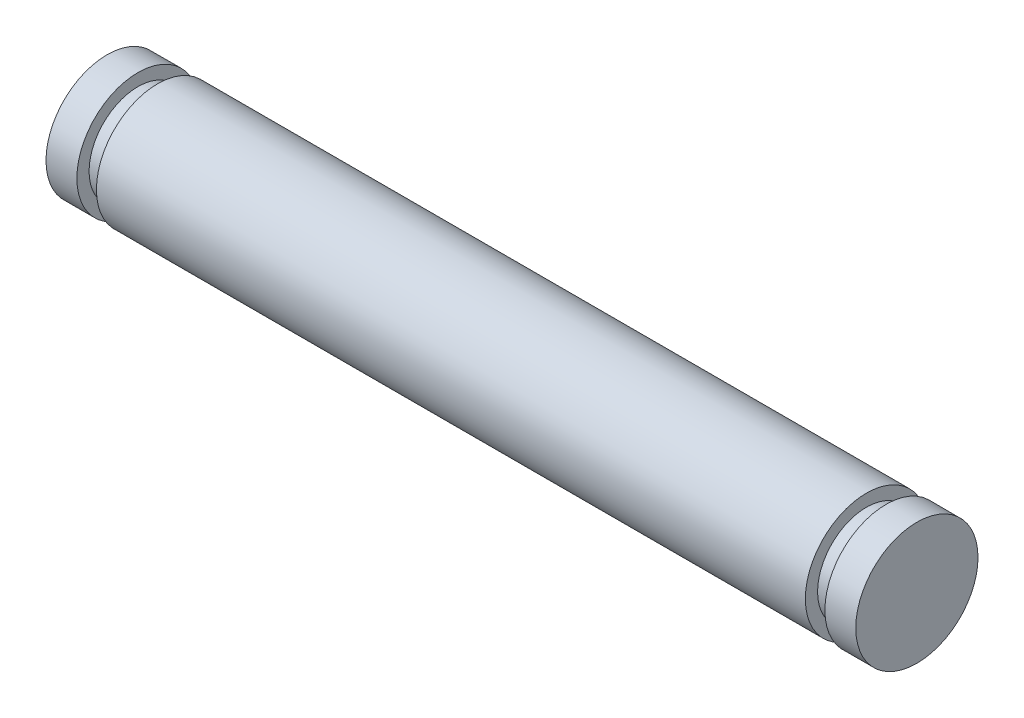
from build123d import *

# Parameters (mm, degrees)
SKETCH1_R           = 2
BOSS_EXTRUDE1_DEPTH = 13.25
SKETCH2_W           = 0.64
SKETCH2_H           = 0.4


with BuildPart() as part:
    # Sketch1 → Boss-Extrude1 (new, symmetric)
    with BuildSketch(Plane(origin=(0, 0, 0), x_dir=(0, 0, -1), z_dir=(1, 0, 0))):
        Circle(SKETCH1_R)
    extrude(amount=BOSS_EXTRUDE1_DEPTH, both=True)

    # Sketch2 → Cut-Revolve1 (revolve, cut)
    with BuildSketch(Plane(origin=(0, 0, 0), x_dir=(1, 0, 0), z_dir=(0, 1, 0)), mode=Mode.PRIVATE) as cut_revolve1_sk:
        with Locations((-11.92, 1.8)):
            Rectangle(SKETCH2_W, SKETCH2_H)
    cut_revolve1 = revolve(cut_revolve1_sk.sketch.rotate(Axis((-14.575, 0, 0), (1, 0, 0)), 180), axis=Axis((-14.575, 0, 0), (1, 0, 0)), mode=Mode.SUBTRACT)

    # Mirror1: Cut-Revolve1 across plane
    add(cut_revolve1.mirror(Plane(origin=(0, 0, 0), x_dir=(0, 0, 1), z_dir=(1, 0, 0))), mode=Mode.SUBTRACT)


solid = part.part
